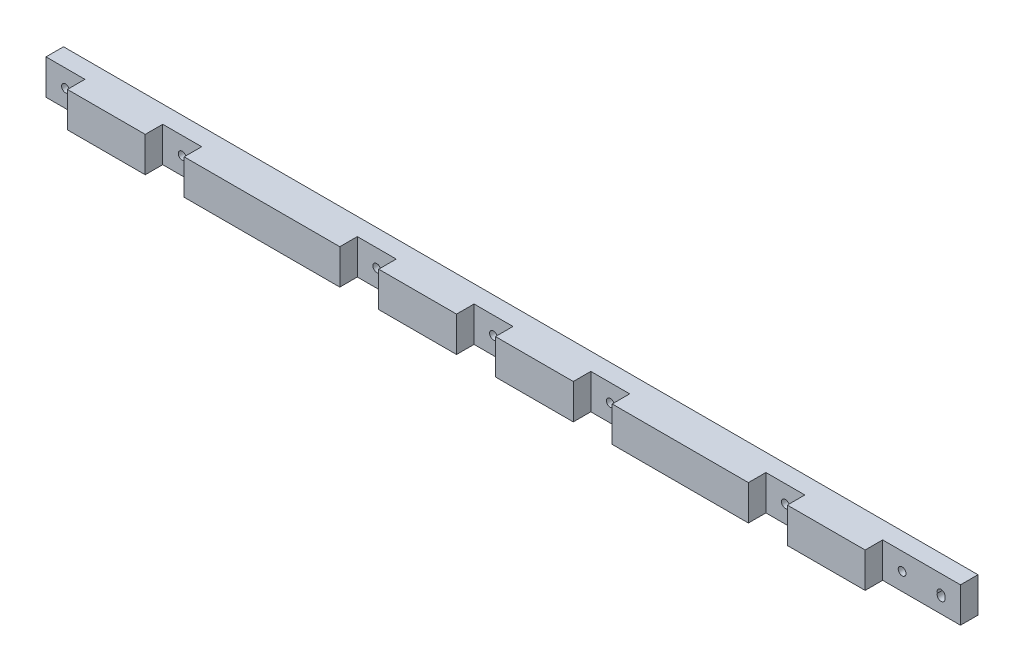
from build123d import *

# Parameters (mm, degrees)
ESQUISSE1_W              = 235
ESQUISSE1_H              = 9
EXTRUSION1_DEPTH         = 9
ESQUISSE2_W              = 10
ESQUISSE2_H              = 9
ENL_V_MAT_EXTRU_1_DEPTH  = 4.5
ESQUISSE3_R              = 1
ENL_V_MAT_EXTRU_2_DEPTH  = 4.5
ESQUISSE4_W              = 10
ESQUISSE4_H              = 9
ENL_V_MAT_EXTRU_3_DEPTH  = 4.5
ESQUISSE5_R              = 1
ENL_V_MAT_EXTRU_4_DEPTH  = 4.5
ESQUISSE6_W              = 10
ESQUISSE6_H              = 9
ENL_V_MAT_EXTRU_5_DEPTH  = 4.5
ESQUISSE7_R              = 1
ENL_V_MAT_EXTRU_6_DEPTH  = 4.5
ESQUISSE8_W              = 10
ESQUISSE8_H              = 9
ENL_V_MAT_EXTRU_7_DEPTH  = 4.5
ESQUISSE9_R              = 1
ENL_V_MAT_EXTRU_8_DEPTH  = 4.5
ESQUISSE10_W             = 10
ESQUISSE10_H             = 9
ENL_V_MAT_EXTRU_9_DEPTH  = 4.5
ESQUISSE11_R             = 1
ENL_V_MAT_EXTRU_10_DEPTH = 4.5
ESQUISSE12_W             = 10
ESQUISSE12_H             = 9
ENL_V_MAT_EXTRU_11_DEPTH = 4.5
ESQUISSE13_R             = 1
ENL_V_MAT_EXTRU_12_DEPTH = 4.5
ESQUISSE14_W             = 10
ESQUISSE14_H             = 9
ENL_V_MAT_EXTRU_13_DEPTH = 4.5
ESQUISSE15_R             = 1
ENL_V_MAT_EXTRU_14_DEPTH = 4.5
ESQUISSE17_W             = 10
ESQUISSE17_H             = 9
ENL_V_MAT_EXTRU_15_DEPTH = 4.5
ESQUISSE20_R             = 1
ENL_V_MAT_EXTRU_17_DEPTH = 4.5
ESQUISSE18_R             = 1
ENL_V_MAT_EXTRU_16_DEPTH = 4.5


with BuildPart() as part:
    # Esquisse1 → Extrusion1 (new body)
    with BuildSketch(Plane.XY):
        with Locations((117.5, 4.5)):
            Rectangle(ESQUISSE1_W, ESQUISSE1_H)
    extrude(amount=EXTRUSION1_DEPTH)

    # Esquisse2 → Enl_v. mat.-Extru.1 (cut)
    with BuildSketch(Plane.XY.offset(9)):
        with Locations((5, 4.5)):
            Rectangle(ESQUISSE2_W, ESQUISSE2_H)
    extrude(amount=-ENL_V_MAT_EXTRU_1_DEPTH, mode=Mode.SUBTRACT)

    # Esquisse3 → Enl_v. mat.-Extru.2 (cut)
    with BuildSketch(Plane.XY.offset(4.5)):
        with Locations((5, 4.5)):
            Circle(ESQUISSE3_R)
    extrude(amount=-ENL_V_MAT_EXTRU_2_DEPTH, mode=Mode.SUBTRACT)

    # Esquisse4 → Enl_v. mat.-Extru.3 (cut)
    with BuildSketch(Plane.XY.offset(9)):
        with Locations((35, 4.5)):
            Rectangle(ESQUISSE4_W, ESQUISSE4_H)
    extrude(amount=-ENL_V_MAT_EXTRU_3_DEPTH, mode=Mode.SUBTRACT)

    # Esquisse5 → Enl_v. mat.-Extru.4 (cut)
    with BuildSketch(Plane.XY.offset(4.5)):
        with Locations((35, 4.5)):
            Circle(ESQUISSE5_R)
    extrude(amount=-ENL_V_MAT_EXTRU_4_DEPTH, mode=Mode.SUBTRACT)

    # Esquisse6 → Enl_v. mat.-Extru.5 (cut)
    with BuildSketch(Plane.XY.offset(9)):
        with Locations((85, 4.5)):
            Rectangle(ESQUISSE6_W, ESQUISSE6_H)
    extrude(amount=-ENL_V_MAT_EXTRU_5_DEPTH, mode=Mode.SUBTRACT)

    # Esquisse7 → Enl_v. mat.-Extru.6 (cut)
    with BuildSketch(Plane.XY.offset(4.5)):
        with Locations((85, 4.5)):
            Circle(ESQUISSE7_R)
    extrude(amount=-ENL_V_MAT_EXTRU_6_DEPTH, mode=Mode.SUBTRACT)

    # Esquisse8 → Enl_v. mat.-Extru.7 (cut)
    with BuildSketch(Plane.XY.offset(9)):
        with Locations((115, 4.5)):
            Rectangle(ESQUISSE8_W, ESQUISSE8_H)
    extrude(amount=-ENL_V_MAT_EXTRU_7_DEPTH, mode=Mode.SUBTRACT)

    # Esquisse9 → Enl_v. mat.-Extru.8 (cut)
    with BuildSketch(Plane.XY.offset(4.5)):
        with Locations((115, 4.5)):
            Circle(ESQUISSE9_R)
    extrude(amount=-ENL_V_MAT_EXTRU_8_DEPTH, mode=Mode.SUBTRACT)

    # Esquisse10 → Enl_v. mat.-Extru.9 (cut)
    with BuildSketch(Plane.XY.offset(9)):
        with Locations((145, 4.5)):
            Rectangle(ESQUISSE10_W, ESQUISSE10_H)
    extrude(amount=-ENL_V_MAT_EXTRU_9_DEPTH, mode=Mode.SUBTRACT)

    # Esquisse11 → Enl_v. mat.-Extru.10 (cut)
    with BuildSketch(Plane.XY.offset(4.5)):
        with Locations((145, 4.5)):
            Circle(ESQUISSE11_R)
    extrude(amount=-ENL_V_MAT_EXTRU_10_DEPTH, mode=Mode.SUBTRACT)

    # Esquisse12 → Enl_v. mat.-Extru.11 (cut)
    with BuildSketch(Plane.XY.offset(9)):
        with Locations((190, 4.5)):
            Rectangle(ESQUISSE12_W, ESQUISSE12_H)
    extrude(amount=-ENL_V_MAT_EXTRU_11_DEPTH, mode=Mode.SUBTRACT)

    # Esquisse13 → Enl_v. mat.-Extru.12 (cut)
    with BuildSketch(Plane.XY.offset(4.5)):
        with Locations((190, 4.5)):
            Circle(ESQUISSE13_R)
    extrude(amount=-ENL_V_MAT_EXTRU_12_DEPTH, mode=Mode.SUBTRACT)

    # Esquisse14 → Enl_v. mat.-Extru.13 (cut)
    with BuildSketch(Plane.XY.offset(9)):
        with Locations((220, 4.5)):
            Rectangle(ESQUISSE14_W, ESQUISSE14_H)
    extrude(amount=-ENL_V_MAT_EXTRU_13_DEPTH, mode=Mode.SUBTRACT)

    # Esquisse15 → Enl_v. mat.-Extru.14 (cut)
    with BuildSketch(Plane.XY.offset(4.5)):
        with Locations((220, 4.5)):
            Circle(ESQUISSE15_R)
    extrude(amount=-ENL_V_MAT_EXTRU_14_DEPTH, mode=Mode.SUBTRACT)

    # Esquisse17 → Enl_v. mat.-Extru.15 (cut)
    with BuildSketch(Plane.XY.offset(9)):
        with Locations((230, 4.5)):
            Rectangle(ESQUISSE17_W, ESQUISSE17_H)
    extrude(amount=-ENL_V_MAT_EXTRU_15_DEPTH, mode=Mode.SUBTRACT)

    # Esquisse20 → Enl_v. mat.-Extru.17 (cut)
    with BuildSketch(Plane.XY.offset(4.5)):
        with Locations((230, 4.5)):
            Circle(ESQUISSE20_R)
    extrude(amount=-ENL_V_MAT_EXTRU_17_DEPTH, mode=Mode.SUBTRACT)

    # Esquisse18 → Enl_v. mat.-Extru.16 (cut)
    with BuildSketch(Plane.XY.offset(4.5)):
        with Locations((230, 3.81575374)):
            Circle(ESQUISSE18_R)
    extrude(amount=-ENL_V_MAT_EXTRU_16_DEPTH, mode=Mode.SUBTRACT)


solid = part.part
